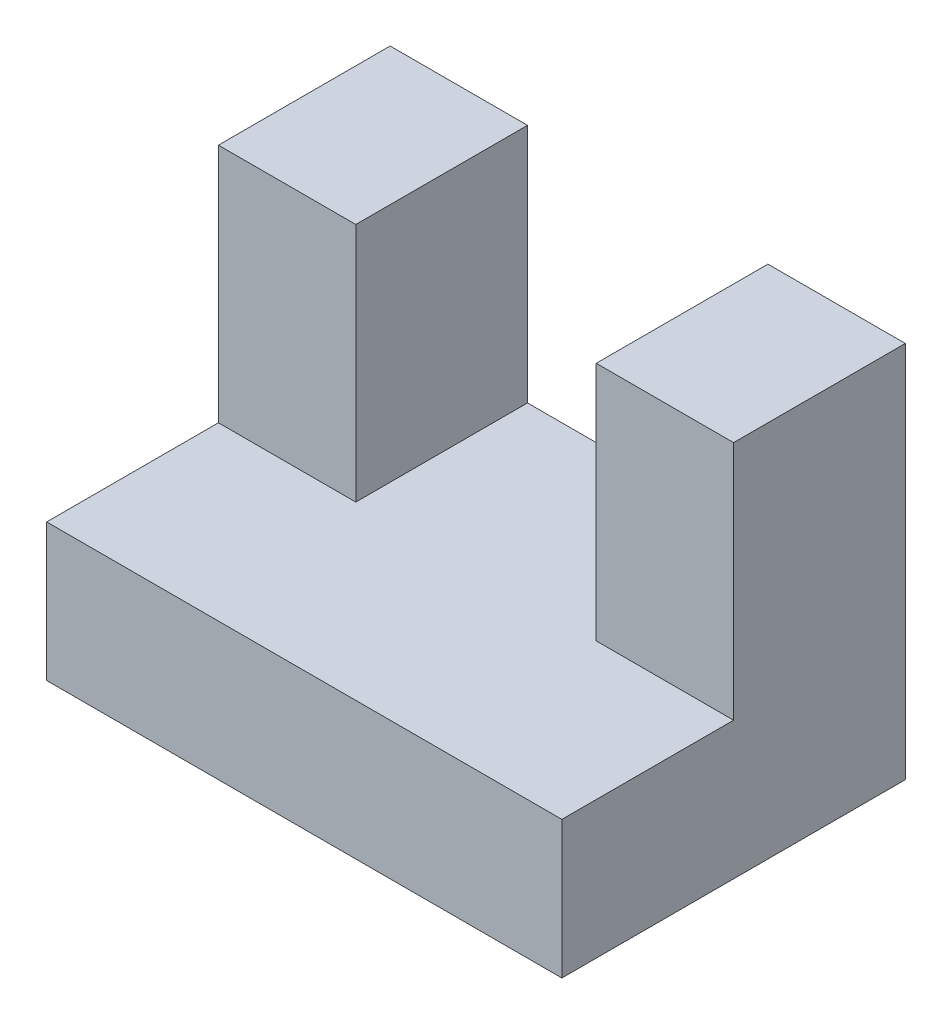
from build123d import *

# Parameters (mm, degrees)
SKETCH_1_W      = 30
SKETCH_1_H      = 20
EXTRUDE_1_DEPTH = 8
SKETCH_2_W      = 8
SKETCH_2_H      = 10
EXTRUDE_2_DEPTH = 14


with BuildPart() as part:
    # Sketch 1 → Extrude 1 (new body)
    with BuildSketch(Plane(origin=(0, 0, 0), x_dir=(1, 0, 0), z_dir=(0, 1, 0))):
        with Locations((15, 10)):
            Rectangle(SKETCH_1_W, SKETCH_1_H)
    extrude(amount=EXTRUDE_1_DEPTH)

    # Sketch 2 → Extrude 2 (add)
    with BuildSketch(Plane(origin=(0, 8, 0), x_dir=(1, 0, 0), z_dir=(0, 1, 0))):
        with Locations((4, 15)):
            Rectangle(SKETCH_2_W, SKETCH_2_H)
        with Locations((26, 15)):
            Rectangle(SKETCH_2_W, SKETCH_2_H)
    extrude(amount=EXTRUDE_2_DEPTH)


solid = part.part
